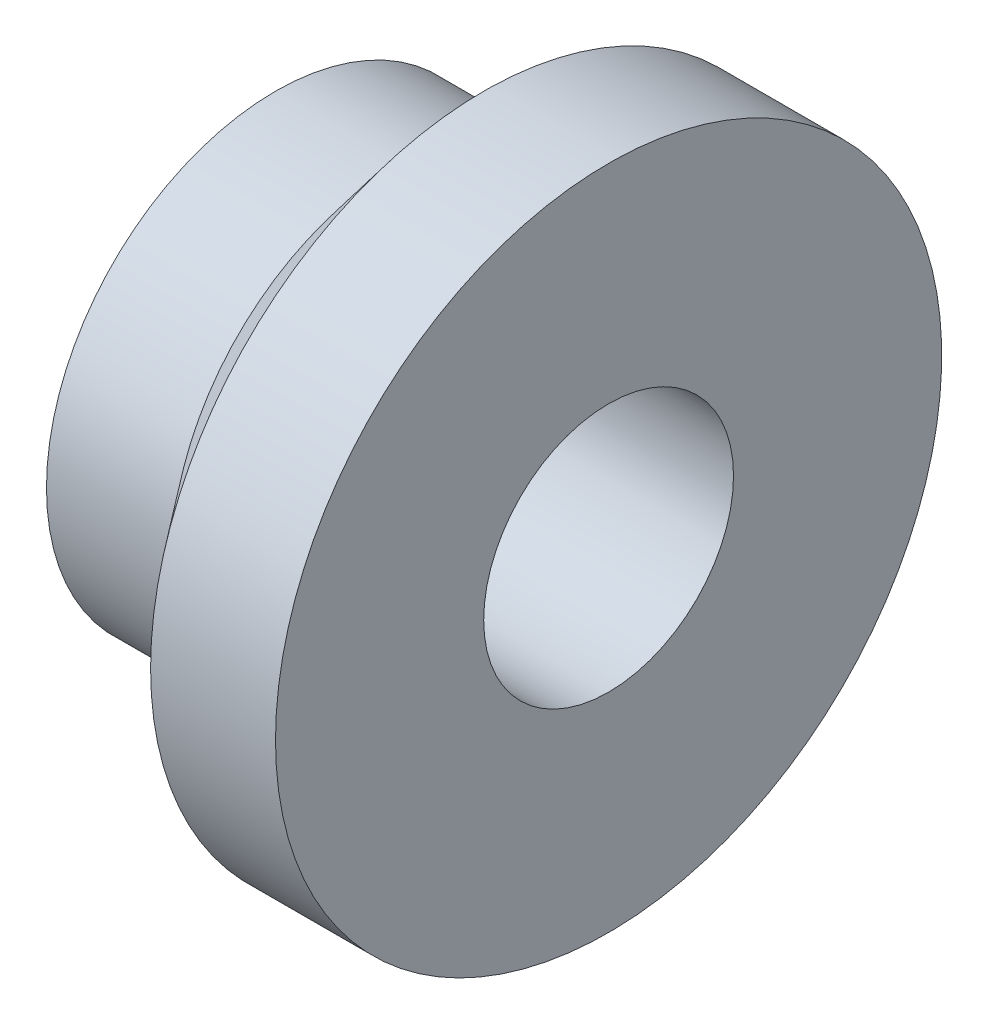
ISO-10303-21;
HEADER;
FILE_DESCRIPTION(('STEP AP214'),'2;1');
FILE_NAME('part.step','',(''),(''),'','','');
FILE_SCHEMA(('AUTOMOTIVE_DESIGN { 1 0 10303 214 1 1 1 1 }'));
ENDSEC;
DATA;
#1=APPLICATION_CONTEXT('core data for automotive mechanical design processes');
#2=APPLICATION_PROTOCOL_DEFINITION('international standard','automotive_design',2000,#1);
#3=PRODUCT_CONTEXT('',#1,'mechanical');
#4=PRODUCT('Part','Part','',(#3));
#5=PRODUCT_RELATED_PRODUCT_CATEGORY('part','',(#4));
#6=PRODUCT_DEFINITION_FORMATION('','',#4);
#7=PRODUCT_DEFINITION_CONTEXT('part definition',#1,'design');
#8=PRODUCT_DEFINITION('design','',#6,#7);
#9=PRODUCT_DEFINITION_SHAPE('','',#8);
#10=(LENGTH_UNIT() NAMED_UNIT(*) SI_UNIT(.MILLI.,.METRE.));
#11=(NAMED_UNIT(*) PLANE_ANGLE_UNIT() SI_UNIT($,.RADIAN.));
#12=(NAMED_UNIT(*) SI_UNIT($,.STERADIAN.) SOLID_ANGLE_UNIT());
#13=UNCERTAINTY_MEASURE_WITH_UNIT(LENGTH_MEASURE(1.E-05),#10,'distance_accuracy_value','');
#14=(GEOMETRIC_REPRESENTATION_CONTEXT(3) GLOBAL_UNCERTAINTY_ASSIGNED_CONTEXT((#13)) GLOBAL_UNIT_ASSIGNED_CONTEXT((#10,
#11,#12)) REPRESENTATION_CONTEXT('',''));
#15=CARTESIAN_POINT('',(0.,0.,0.));
#16=DIRECTION('',(0.,0.,1.));
#17=DIRECTION('',(1.,0.,0.));
#18=AXIS2_PLACEMENT_3D('',#15,#16,#17);
#19=CARTESIAN_POINT('',(0.,2.75,0.));
#20=DIRECTION('',(1.,0.,0.));
#21=DIRECTION('',(0.,0.,-1.));
#22=AXIS2_PLACEMENT_3D('',#19,#20,#21);
#23=PLANE('',#22);
#24=CARTESIAN_POINT('',(0.,0.,0.));
#25=DIRECTION('',(-1.,0.,0.));
#26=DIRECTION('',(0.,0.,1.));
#27=AXIS2_PLACEMENT_3D('',#24,#25,#26);
#28=CIRCLE('',#27,1.5);
#29=CARTESIAN_POINT('',(0.,0.,1.5));
#30=VERTEX_POINT('',#29);
#31=EDGE_CURVE('E10',#30,#30,#28,.T.);
#32=ORIENTED_EDGE('',*,*,#31,.F.);
#33=EDGE_LOOP('',(#32));
#34=FACE_BOUND('',#33,.T.);
#35=CARTESIAN_POINT('',(0.,0.,0.));
#36=DIRECTION('',(-1.,0.,0.));
#37=DIRECTION('',(0.,0.,1.));
#38=AXIS2_PLACEMENT_3D('',#35,#36,#37);
#39=CIRCLE('',#38,2.75);
#40=CARTESIAN_POINT('',(0.,0.,2.75));
#41=VERTEX_POINT('',#40);
#42=EDGE_CURVE('E55',#41,#41,#39,.T.);
#43=ORIENTED_EDGE('',*,*,#42,.T.);
#44=EDGE_LOOP('',(#43));
#45=FACE_BOUND('',#44,.T.);
#46=ADVANCED_FACE('F33',(#34,#45),#23,.F.);
#47=CARTESIAN_POINT('',(0.,0.,0.));
#48=DIRECTION('',(-1.,0.,0.));
#49=DIRECTION('',(0.,0.,1.));
#50=AXIS2_PLACEMENT_3D('',#47,#48,#49);
#51=CYLINDRICAL_SURFACE('',#50,1.5);
#52=CARTESIAN_POINT('',(4.,0.,0.));
#53=DIRECTION('',(-1.,0.,0.));
#54=DIRECTION('',(0.,0.,1.));
#55=AXIS2_PLACEMENT_3D('',#52,#53,#54);
#56=CIRCLE('',#55,1.5);
#57=CARTESIAN_POINT('',(4.,0.,1.5));
#58=VERTEX_POINT('',#57);
#59=EDGE_CURVE('E39',#58,#58,#56,.T.);
#60=ORIENTED_EDGE('',*,*,#59,.F.);
#61=EDGE_LOOP('',(#60));
#62=FACE_BOUND('',#61,.T.);
#63=ORIENTED_EDGE('',*,*,#31,.T.);
#64=EDGE_LOOP('',(#63));
#65=FACE_BOUND('',#64,.T.);
#66=ADVANCED_FACE('F80',(#62,#65),#51,.F.);
#67=CARTESIAN_POINT('',(4.,1.5,0.));
#68=DIRECTION('',(-1.,0.,0.));
#69=DIRECTION('',(0.,0.,1.));
#70=AXIS2_PLACEMENT_3D('',#67,#68,#69);
#71=PLANE('',#70);
#72=CARTESIAN_POINT('',(4.,0.,0.));
#73=DIRECTION('',(-1.,0.,0.));
#74=DIRECTION('',(0.,0.,1.));
#75=AXIS2_PLACEMENT_3D('',#72,#73,#74);
#76=CIRCLE('',#75,4.);
#77=CARTESIAN_POINT('',(4.,0.,4.));
#78=VERTEX_POINT('',#77);
#79=EDGE_CURVE('E43',#78,#78,#76,.T.);
#80=ORIENTED_EDGE('',*,*,#79,.F.);
#81=EDGE_LOOP('',(#80));
#82=FACE_BOUND('',#81,.T.);
#83=ORIENTED_EDGE('',*,*,#59,.T.);
#84=EDGE_LOOP('',(#83));
#85=FACE_BOUND('',#84,.T.);
#86=ADVANCED_FACE('F75',(#82,#85),#71,.F.);
#87=CARTESIAN_POINT('',(0.,0.,0.));
#88=DIRECTION('',(-1.,0.,0.));
#89=DIRECTION('',(0.,0.,1.));
#90=AXIS2_PLACEMENT_3D('',#87,#88,#89);
#91=CYLINDRICAL_SURFACE('',#90,4.);
#92=CARTESIAN_POINT('',(2.5,0.,0.));
#93=DIRECTION('',(-1.,0.,0.));
#94=DIRECTION('',(0.,0.,1.));
#95=AXIS2_PLACEMENT_3D('',#92,#93,#94);
#96=CIRCLE('',#95,4.);
#97=CARTESIAN_POINT('',(2.5,0.,4.));
#98=VERTEX_POINT('',#97);
#99=EDGE_CURVE('E47',#98,#98,#96,.T.);
#100=ORIENTED_EDGE('',*,*,#99,.F.);
#101=EDGE_LOOP('',(#100));
#102=FACE_BOUND('',#101,.T.);
#103=ORIENTED_EDGE('',*,*,#79,.T.);
#104=EDGE_LOOP('',(#103));
#105=FACE_BOUND('',#104,.T.);
#106=ADVANCED_FACE('F69',(#102,#105),#91,.T.);
#107=CARTESIAN_POINT('',(2.5,0.,0.));
#108=DIRECTION('',(1.,0.,0.));
#109=DIRECTION('',(0.,0.,-1.));
#110=AXIS2_PLACEMENT_3D('',#107,#108,#109);
#111=CONICAL_SURFACE('',#110,4.,0.896055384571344);
#112=CARTESIAN_POINT('',(1.5,0.,0.));
#113=DIRECTION('',(-1.,0.,0.));
#114=DIRECTION('',(0.,0.,1.));
#115=AXIS2_PLACEMENT_3D('',#112,#113,#114);
#116=CIRCLE('',#115,2.75);
#117=CARTESIAN_POINT('',(1.5,0.,2.75));
#118=VERTEX_POINT('',#117);
#119=EDGE_CURVE('E52',#118,#118,#116,.T.);
#120=ORIENTED_EDGE('',*,*,#119,.F.);
#121=EDGE_LOOP('',(#120));
#122=FACE_BOUND('',#121,.T.);
#123=ORIENTED_EDGE('',*,*,#99,.T.);
#124=EDGE_LOOP('',(#123));
#125=FACE_BOUND('',#124,.T.);
#126=ADVANCED_FACE('F63',(#122,#125),#111,.T.);
#127=CARTESIAN_POINT('',(0.,0.,0.));
#128=DIRECTION('',(-1.,0.,0.));
#129=DIRECTION('',(0.,0.,1.));
#130=AXIS2_PLACEMENT_3D('',#127,#128,#129);
#131=CYLINDRICAL_SURFACE('',#130,2.75);
#132=ORIENTED_EDGE('',*,*,#42,.F.);
#133=EDGE_LOOP('',(#132));
#134=FACE_BOUND('',#133,.T.);
#135=ORIENTED_EDGE('',*,*,#119,.T.);
#136=EDGE_LOOP('',(#135));
#137=FACE_BOUND('',#136,.T.);
#138=ADVANCED_FACE('F60',(#134,#137),#131,.T.);
#139=CLOSED_SHELL('',(#46,#66,#86,#106,#126,#138));
#140=MANIFOLD_SOLID_BREP('B2',#139);
#141=ADVANCED_BREP_SHAPE_REPRESENTATION('',(#18,#140),#14);
#142=SHAPE_DEFINITION_REPRESENTATION(#9,#141);
ENDSEC;
END-ISO-10303-21;
